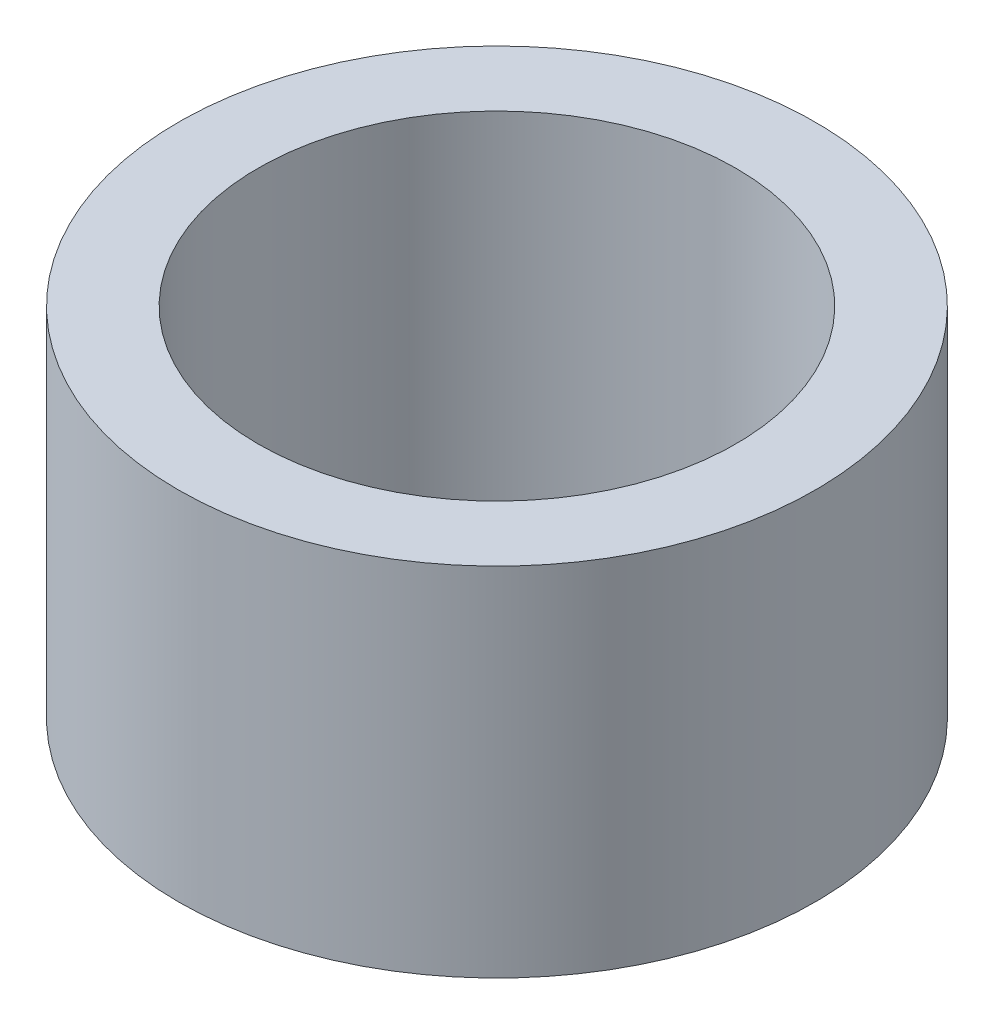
from build123d import *

# Parameters (mm, degrees)
SKETCH1_R      = 6.35
SKETCH1_R_2    = 4.7625
EXTRUDE1_DEPTH = 7.112


with BuildPart() as part:
    # Sketch1 → Extrude1 (new body)
    with BuildSketch(Plane(origin=(0, 0, 0), x_dir=(1, 0, 0), z_dir=(0, 1, 0))):
        with Locations(Location((0, 0, 0), (0, 0, 270))):
            Circle(SKETCH1_R)
        with Locations(Location((0, 0, 0), (0, 0, 270))):
            Circle(SKETCH1_R_2, mode=Mode.SUBTRACT)
    extrude(amount=EXTRUDE1_DEPTH)


solid = part.part
